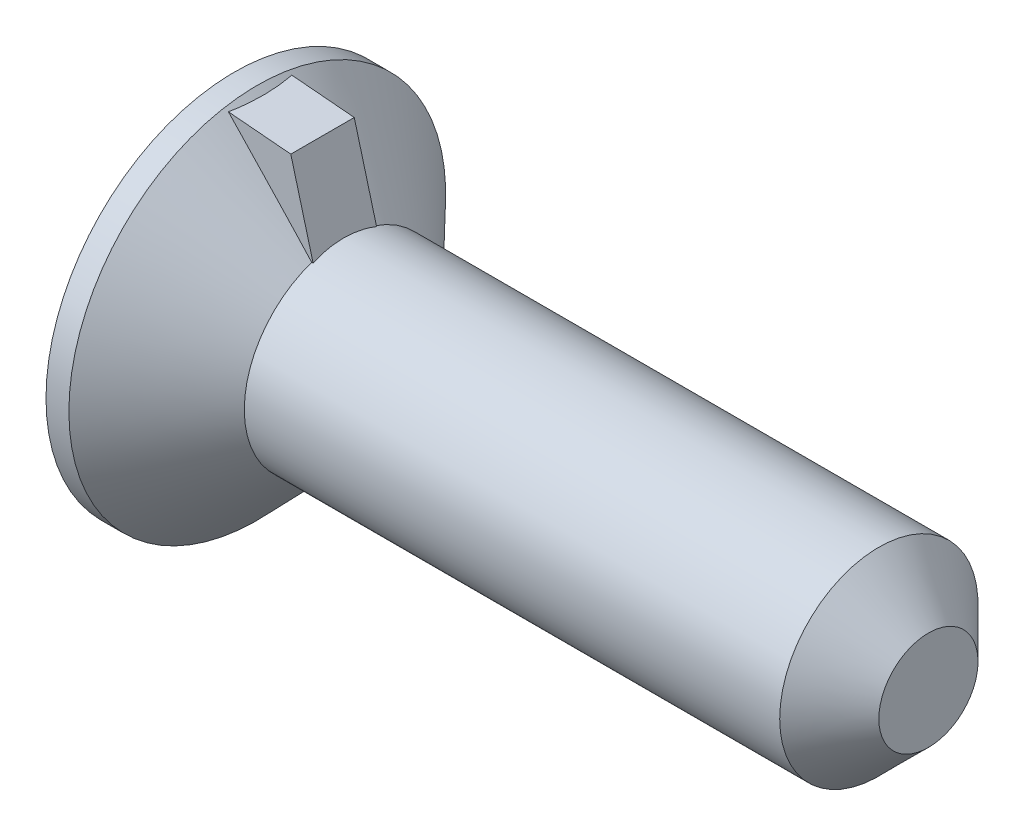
from build123d import *

# Parameters (mm, degrees)
NIB_DEPTH = 1.6


with BuildPart() as part:
    # BodySke → BaseBody (revolve)
    with BuildSketch(Plane.XY, mode=Mode.PRIVATE) as basebody_sk:
        Polygon((0, 0), (0, 9.5), (1.154400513, 9.5), (5.5, 5), (32.5, 5), (35, 2.5), (35, 0), align=None)
    revolve(basebody_sk.sketch.rotate(Axis((0, 0, 0), (1, 0, 0)), 90), axis=Axis((0, 0, 0), (1, 0, 0)))

    # NibSke → Nib (add, symmetric)
    with BuildSketch(Plane.XY):
        Polygon((4.444960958, 8.937459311), (6.839745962, 0), (1.154400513, 0), (1.154400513, 9.225346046), align=None)
    extrude(amount=NIB_DEPTH, both=True)


solid = part.part
